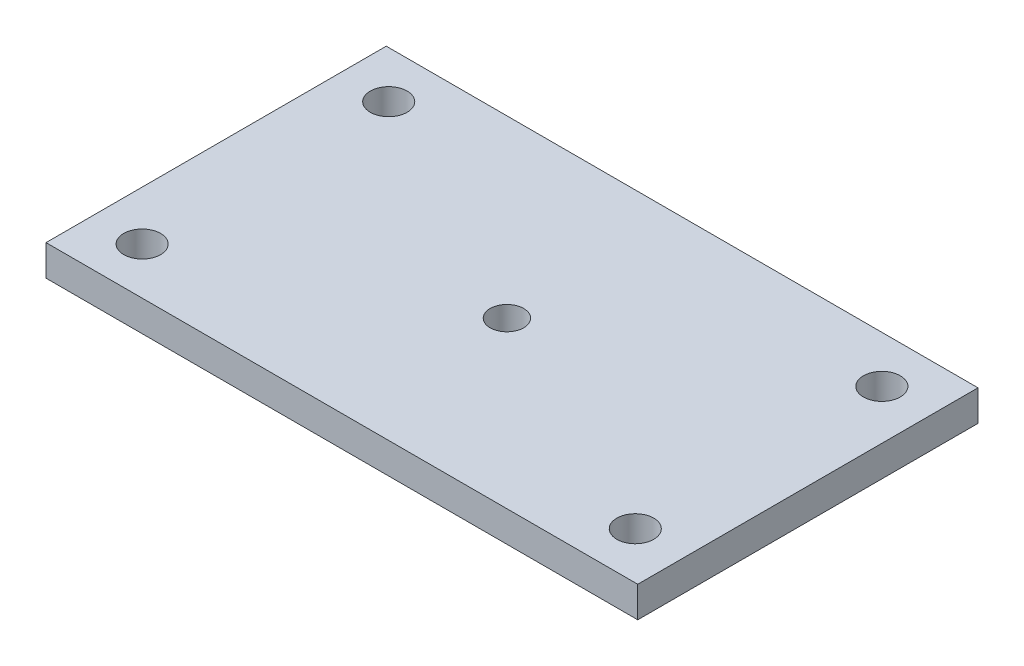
from build123d import *

# Parameters (mm, degrees)
SKETCH1_W                    = 60.96
SKETCH1_H                    = 35.052
BOSS_EXTRUDE1_DEPTH          = 3.175
F_25_0_1495_DIAMETER_HOLE1_D = 3.7973
F_8_32_TAPPED_HOLE1_D        = 3.4544


with BuildPart() as part:
    # Sketch1 → Boss-Extrude1 (new body)
    with BuildSketch(Plane(origin=(0, 0, 0), x_dir=(1, 0, 0), z_dir=(0, 1, 0))):
        with Locations((-26.470492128, 0.523882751)):
            Rectangle(SKETCH1_W, SKETCH1_H)
    extrude(amount=BOSS_EXTRUDE1_DEPTH)

    # 25 _0.1495_ Diameter Hole1 (through all)
    with Locations(Plane(origin=(0, 3.175, 0), x_dir=(1, 0, 0), z_dir=(0, 1, 0))):
        with Locations((-51.870492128, 13.223882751), (-1.070492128, 13.223882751), (-1.070492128, -12.176117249), (-51.870492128, -12.176117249)):
            Hole(F_25_0_1495_DIAMETER_HOLE1_D / 2)

    # 8-32 Tapped Hole1 (through all)
    with Locations(Plane(origin=(0, 0, 0), x_dir=(-1, 0, 0), z_dir=(0, -1, 0))):
        with Locations((26.470492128, 0)):
            Hole(F_8_32_TAPPED_HOLE1_D / 2)


solid = part.part
